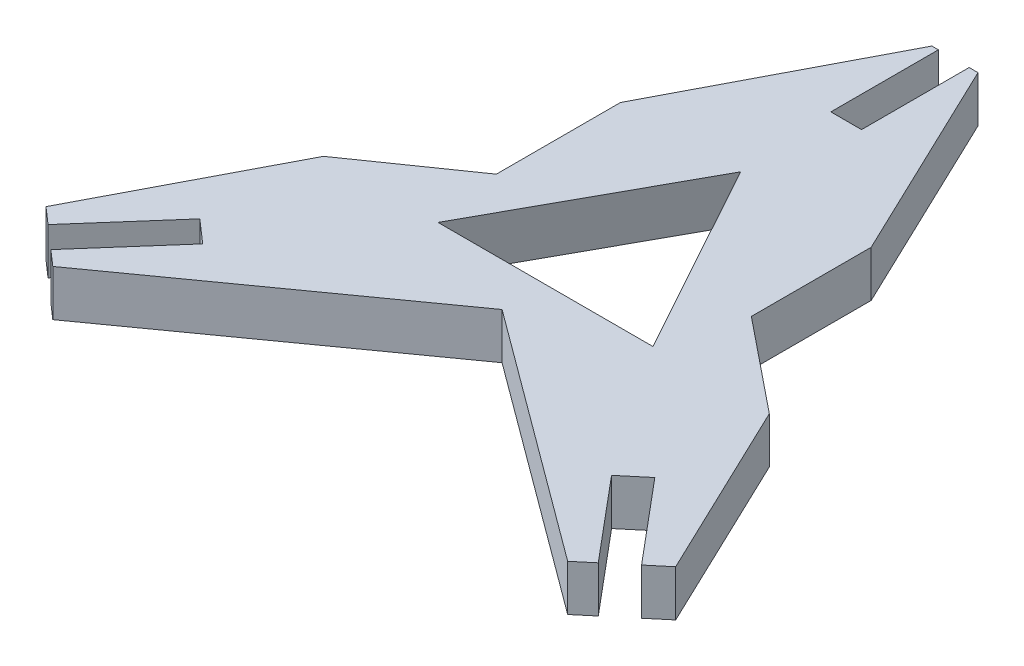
ISO-10303-21;
HEADER;
FILE_DESCRIPTION(('STEP AP214'),'2;1');
FILE_NAME('part.step','',(''),(''),'','','');
FILE_SCHEMA(('AUTOMOTIVE_DESIGN { 1 0 10303 214 1 1 1 1 }'));
ENDSEC;
DATA;
#1=APPLICATION_CONTEXT('core data for automotive mechanical design processes');
#2=APPLICATION_PROTOCOL_DEFINITION('international standard','automotive_design',2000,#1);
#3=PRODUCT_CONTEXT('',#1,'mechanical');
#4=PRODUCT('Part','Part','',(#3));
#5=PRODUCT_RELATED_PRODUCT_CATEGORY('part','',(#4));
#6=PRODUCT_DEFINITION_FORMATION('','',#4);
#7=PRODUCT_DEFINITION_CONTEXT('part definition',#1,'design');
#8=PRODUCT_DEFINITION('design','',#6,#7);
#9=PRODUCT_DEFINITION_SHAPE('','',#8);
#10=(LENGTH_UNIT() NAMED_UNIT(*) SI_UNIT(.MILLI.,.METRE.));
#11=(NAMED_UNIT(*) PLANE_ANGLE_UNIT() SI_UNIT($,.RADIAN.));
#12=(NAMED_UNIT(*) SI_UNIT($,.STERADIAN.) SOLID_ANGLE_UNIT());
#13=UNCERTAINTY_MEASURE_WITH_UNIT(LENGTH_MEASURE(1.E-05),#10,'distance_accuracy_value','');
#14=(GEOMETRIC_REPRESENTATION_CONTEXT(3) GLOBAL_UNCERTAINTY_ASSIGNED_CONTEXT((#13)) GLOBAL_UNIT_ASSIGNED_CONTEXT((#10,
#11,#12)) REPRESENTATION_CONTEXT('',''));
#15=CARTESIAN_POINT('',(0.,0.,0.));
#16=DIRECTION('',(0.,0.,1.));
#17=DIRECTION('',(1.,0.,0.));
#18=AXIS2_PLACEMENT_3D('',#15,#16,#17);
#19=CARTESIAN_POINT('',(21.2506488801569,3.,-10.1559719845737));
#20=DIRECTION('',(0.902256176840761,0.,-0.431200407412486));
#21=DIRECTION('',(-0.431200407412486,0.,-0.902256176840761));
#22=AXIS2_PLACEMENT_3D('',#19,#20,#21);
#23=PLANE('',#22);
#24=DIRECTION('',(0.,1.,0.));
#25=VECTOR('',#24,1.);
#26=CARTESIAN_POINT('',(39.969209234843,0.,29.0112839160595));
#27=LINE('',#26,#25);
#28=CARTESIAN_POINT('',(39.969209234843,0.,29.0112839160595));
#29=VERTEX_POINT('',#28);
#30=CARTESIAN_POINT('',(39.969209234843,3.,29.0112839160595));
#31=VERTEX_POINT('',#30);
#32=EDGE_CURVE('E531',#29,#31,#27,.T.);
#33=ORIENTED_EDGE('',*,*,#32,.T.);
#34=DIRECTION('',(0.431200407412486,0.,0.902256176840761));
#35=VECTOR('',#34,1.);
#36=CARTESIAN_POINT('',(21.2506488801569,3.,-10.1559719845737));
#37=LINE('',#36,#35);
#38=CARTESIAN_POINT('',(45.5472114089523,3.,40.6828566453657));
#39=VERTEX_POINT('',#38);
#40=EDGE_CURVE('E283',#31,#39,#37,.T.);
#41=ORIENTED_EDGE('',*,*,#40,.T.);
#42=DIRECTION('',(0.,1.,0.));
#43=VECTOR('',#42,1.);
#44=CARTESIAN_POINT('',(45.5472114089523,0.,40.6828566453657));
#45=LINE('',#44,#43);
#46=CARTESIAN_POINT('',(45.5472114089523,0.,40.6828566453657));
#47=VERTEX_POINT('',#46);
#48=EDGE_CURVE('E369',#47,#39,#45,.T.);
#49=ORIENTED_EDGE('',*,*,#48,.F.);
#50=DIRECTION('',(0.431200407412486,0.,0.902256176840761));
#51=VECTOR('',#50,1.);
#52=CARTESIAN_POINT('',(21.2506488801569,0.,-10.1559719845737));
#53=LINE('',#52,#51);
#54=EDGE_CURVE('E555',#29,#47,#53,.T.);
#55=ORIENTED_EDGE('',*,*,#54,.F.);
#56=EDGE_LOOP('',(#33,#41,#49,#55));
#57=FACE_BOUND('',#56,.T.);
#58=ADVANCED_FACE('F65',(#57),#23,.T.);
#59=CARTESIAN_POINT('',(20.5130063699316,3.,10.7095636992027));
#60=DIRECTION('',(-0.886458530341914,0.,-0.462808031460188));
#61=DIRECTION('',(-0.462808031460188,0.,0.886458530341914));
#62=AXIS2_PLACEMENT_3D('',#59,#60,#61);
#63=PLANE('',#62);
#64=DIRECTION('',(0.,1.,0.));
#65=VECTOR('',#64,1.);
#66=CARTESIAN_POINT('',(10.9579253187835,0.,29.0112839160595));
#67=LINE('',#66,#65);
#68=CARTESIAN_POINT('',(10.9579253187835,0.,29.0112839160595));
#69=VERTEX_POINT('',#68);
#70=CARTESIAN_POINT('',(10.9579253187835,3.,29.0112839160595));
#71=VERTEX_POINT('',#70);
#72=EDGE_CURVE('E459',#69,#71,#67,.T.);
#73=ORIENTED_EDGE('',*,*,#72,.F.);
#74=DIRECTION('',(0.462808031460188,0.,-0.886458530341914));
#75=VECTOR('',#74,1.);
#76=CARTESIAN_POINT('',(20.5130063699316,0.,10.7095636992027));
#77=LINE('',#76,#75);
#78=CARTESIAN_POINT('',(4.76326950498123,0.,40.8764744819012));
#79=VERTEX_POINT('',#78);
#80=EDGE_CURVE('E461',#79,#69,#77,.T.);
#81=ORIENTED_EDGE('',*,*,#80,.F.);
#82=DIRECTION('',(0.,1.,0.));
#83=VECTOR('',#82,1.);
#84=CARTESIAN_POINT('',(4.76326950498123,0.,40.8764744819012));
#85=LINE('',#84,#83);
#86=CARTESIAN_POINT('',(4.76326950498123,3.,40.8764744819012));
#87=VERTEX_POINT('',#86);
#88=EDGE_CURVE('E424',#79,#87,#85,.T.);
#89=ORIENTED_EDGE('',*,*,#88,.T.);
#90=DIRECTION('',(0.462808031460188,0.,-0.886458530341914));
#91=VECTOR('',#90,1.);
#92=CARTESIAN_POINT('',(20.5130063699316,3.,10.7095636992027));
#93=LINE('',#92,#91);
#94=EDGE_CURVE('E275',#87,#71,#93,.T.);
#95=ORIENTED_EDGE('',*,*,#94,.T.);
#96=EDGE_LOOP('',(#73,#81,#89,#95));
#97=FACE_BOUND('',#96,.T.);
#98=ADVANCED_FACE('F457',(#97),#63,.T.);
#99=CARTESIAN_POINT('',(0.,3.,0.));
#100=DIRECTION('',(0.,1.,0.));
#101=DIRECTION('',(0.,0.,1.));
#102=AXIS2_PLACEMENT_3D('',#99,#100,#101);
#103=PLANE('',#102);
#104=DIRECTION('',(1.,0.,0.));
#105=VECTOR('',#104,1.);
#106=CARTESIAN_POINT('',(24.96076274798,3.,3.));
#107=LINE('',#106,#105);
#108=CARTESIAN_POINT('',(24.5380654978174,3.,3.));
#109=VERTEX_POINT('',#108);
#110=CARTESIAN_POINT('',(24.96076274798,3.,3.));
#111=VERTEX_POINT('',#110);
#112=EDGE_CURVE('E252',#109,#111,#107,.T.);
#113=ORIENTED_EDGE('',*,*,#112,.F.);
#114=CARTESIAN_POINT('',(17.5866412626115,3.,16.3146983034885));
#115=VERTEX_POINT('',#114);
#116=EDGE_CURVE('E266',#115,#109,#93,.T.);
#117=ORIENTED_EDGE('',*,*,#116,.F.);
#118=DIRECTION('',(0.,0.,-1.));
#119=VECTOR('',#118,1.);
#120=CARTESIAN_POINT('',(17.5866412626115,3.,16.3146983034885));
#121=LINE('',#120,#119);
#122=CARTESIAN_POINT('',(17.5866412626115,3.,24.3933726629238));
#123=VERTEX_POINT('',#122);
#124=EDGE_CURVE('E88',#123,#115,#121,.T.);
#125=ORIENTED_EDGE('',*,*,#124,.F.);
#126=DIRECTION('',(0.820520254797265,0.,-0.571617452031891));
#127=VECTOR('',#126,1.);
#128=CARTESIAN_POINT('',(17.5866412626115,3.,24.3933726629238));
#129=LINE('',#128,#127);
#130=EDGE_CURVE('E454',#71,#123,#129,.T.);
#131=ORIENTED_EDGE('',*,*,#130,.F.);
#132=ORIENTED_EDGE('',*,*,#94,.F.);
#133=DIRECTION('',(0.751820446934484,0.,0.659367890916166));
#134=VECTOR('',#133,1.);
#135=CARTESIAN_POINT('',(4.83328330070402,3.,40.9378785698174));
#136=LINE('',#135,#134);
#137=CARTESIAN_POINT('',(5.84185846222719,3.,41.822427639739));
#138=VERTEX_POINT('',#137);
#139=EDGE_CURVE('E303',#87,#138,#136,.T.);
#140=ORIENTED_EDGE('',*,*,#139,.T.);
#141=DIRECTION('',(0.659367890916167,0.,-0.751820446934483));
#142=VECTOR('',#141,1.);
#143=CARTESIAN_POINT('',(24.0344926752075,3.,21.0789328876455));
#144=LINE('',#143,#142);
#145=CARTESIAN_POINT('',(10.4574336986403,3.,36.5596845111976));
#146=VERTEX_POINT('',#145);
#147=EDGE_CURVE('E420',#138,#146,#144,.T.);
#148=ORIENTED_EDGE('',*,*,#147,.T.);
#149=DIRECTION('',(-0.751820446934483,0.,-0.659367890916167));
#150=VECTOR('',#149,1.);
#151=CARTESIAN_POINT('',(-13.5770589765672,3.,15.4807516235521));
#152=LINE('',#151,#150);
#153=CARTESIAN_POINT('',(11.9610745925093,3.,37.87842029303));
#154=VERTEX_POINT('',#153);
#155=EDGE_CURVE('E413',#154,#146,#152,.T.);
#156=ORIENTED_EDGE('',*,*,#155,.F.);
#157=DIRECTION('',(0.659367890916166,0.,-0.751820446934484));
#158=VECTOR('',#157,1.);
#159=CARTESIAN_POINT('',(25.5381335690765,3.,22.3976686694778));
#160=LINE('',#159,#158);
#161=CARTESIAN_POINT('',(7.34549935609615,3.,43.1411634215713));
#162=VERTEX_POINT('',#161);
#163=EDGE_CURVE('E425',#162,#154,#160,.T.);
#164=ORIENTED_EDGE('',*,*,#163,.F.);
#165=CARTESIAN_POINT('',(8.35407451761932,3.,44.025712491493));
#166=VERTEX_POINT('',#165);
#167=EDGE_CURVE('E309',#162,#166,#136,.T.);
#168=ORIENTED_EDGE('',*,*,#167,.T.);
#169=DIRECTION('',(0.813406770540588,0.,-0.581695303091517));
#170=VECTOR('',#169,1.);
#171=CARTESIAN_POINT('',(23.6577448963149,3.,33.0815287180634));
#172=LINE('',#171,#170);
#173=CARTESIAN_POINT('',(25.4012074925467,3.,31.8347183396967));
#174=VERTEX_POINT('',#173);
#175=EDGE_CURVE('E73',#166,#174,#172,.T.);
#176=ORIENTED_EDGE('',*,*,#175,.T.);
#177=DIRECTION('',(0.804432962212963,0.,0.594043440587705));
#178=VECTOR('',#177,1.);
#179=CARTESIAN_POINT('',(-6.24902576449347,3.,8.46221330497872));
#180=LINE('',#179,#178);
#181=CARTESIAN_POINT('',(41.7248061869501,3.,43.8890810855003));
#182=VERTEX_POINT('',#181);
#183=EDGE_CURVE('E324',#174,#182,#180,.T.);
#184=ORIENTED_EDGE('',*,*,#183,.T.);
#185=DIRECTION('',(0.766158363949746,0.,-0.642651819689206));
#186=VECTOR('',#185,1.);
#187=CARTESIAN_POINT('',(38.8422032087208,3.,46.3070016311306));
#188=LINE('',#187,#186);
#189=CARTESIAN_POINT('',(42.8073234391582,3.,42.9810681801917));
#190=VERTEX_POINT('',#189);
#191=EDGE_CURVE('E391',#182,#190,#188,.T.);
#192=ORIENTED_EDGE('',*,*,#191,.T.);
#193=DIRECTION('',(-0.642651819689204,0.,-0.766158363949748));
#194=VECTOR('',#193,1.);
#195=CARTESIAN_POINT('',(3.96512023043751,3.,-3.32593345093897));
#196=LINE('',#195,#194);
#197=CARTESIAN_POINT('',(38.3087607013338,3.,37.6179596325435));
#198=VERTEX_POINT('',#197);
#199=EDGE_CURVE('E396',#190,#198,#196,.T.);
#200=ORIENTED_EDGE('',*,*,#199,.T.);
#201=DIRECTION('',(-0.766158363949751,0.,0.642651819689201));
#202=VECTOR('',#201,1.);
#203=CARTESIAN_POINT('',(34.3436404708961,3.,40.9438930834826));
#204=LINE('',#203,#202);
#205=CARTESIAN_POINT('',(39.8410774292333,3.,36.3326559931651));
#206=VERTEX_POINT('',#205);
#207=EDGE_CURVE('E377',#206,#198,#204,.T.);
#208=ORIENTED_EDGE('',*,*,#207,.F.);
#209=DIRECTION('',(-0.642651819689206,0.,-0.766158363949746));
#210=VECTOR('',#209,1.);
#211=CARTESIAN_POINT('',(5.49743695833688,3.,-4.6112370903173));
#212=LINE('',#211,#210);
#213=CARTESIAN_POINT('',(44.3396401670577,3.,41.6957645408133));
#214=VERTEX_POINT('',#213);
#215=EDGE_CURVE('E383',#214,#206,#212,.T.);
#216=ORIENTED_EDGE('',*,*,#215,.F.);
#217=EDGE_CURVE('E395',#214,#39,#188,.T.);
#218=ORIENTED_EDGE('',*,*,#217,.T.);
#219=ORIENTED_EDGE('',*,*,#40,.F.);
#220=DIRECTION('',(0.778106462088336,0.,0.628132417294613));
#221=VECTOR('',#220,1.);
#222=CARTESIAN_POINT('',(39.969209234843,3.,29.0112839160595));
#223=LINE('',#222,#221);
#224=CARTESIAN_POINT('',(33.9013395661,3.,24.1129495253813));
#225=VERTEX_POINT('',#224);
#226=EDGE_CURVE('E543',#225,#31,#223,.T.);
#227=ORIENTED_EDGE('',*,*,#226,.F.);
#228=DIRECTION('',(0.,0.,1.));
#229=VECTOR('',#228,1.);
#230=CARTESIAN_POINT('',(33.9013395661,3.,24.1129495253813));
#231=LINE('',#230,#229);
#232=CARTESIAN_POINT('',(33.9013395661,3.,16.3146983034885));
#233=VERTEX_POINT('',#232);
#234=EDGE_CURVE('E537',#233,#225,#231,.T.);
#235=ORIENTED_EDGE('',*,*,#234,.F.);
#236=CARTESIAN_POINT('',(27.5380654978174,3.,3.));
#237=VERTEX_POINT('',#236);
#238=EDGE_CURVE('E276',#237,#233,#37,.T.);
#239=ORIENTED_EDGE('',*,*,#238,.F.);
#240=DIRECTION('',(1.,0.,0.));
#241=VECTOR('',#240,1.);
#242=CARTESIAN_POINT('',(0.,3.,3.));
#243=LINE('',#242,#241);
#244=CARTESIAN_POINT('',(26.96076274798,3.,3.));
#245=VERTEX_POINT('',#244);
#246=EDGE_CURVE('E490',#245,#237,#243,.T.);
#247=ORIENTED_EDGE('',*,*,#246,.F.);
#248=DIRECTION('',(0.,0.,1.));
#249=VECTOR('',#248,1.);
#250=CARTESIAN_POINT('',(26.96076274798,3.,0.));
#251=LINE('',#250,#249);
#252=CARTESIAN_POINT('',(26.96076274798,3.,10.));
#253=VERTEX_POINT('',#252);
#254=EDGE_CURVE('E485',#245,#253,#251,.T.);
#255=ORIENTED_EDGE('',*,*,#254,.T.);
#256=DIRECTION('',(1.,0.,0.));
#257=VECTOR('',#256,1.);
#258=CARTESIAN_POINT('',(0.,3.,10.));
#259=LINE('',#258,#257);
#260=CARTESIAN_POINT('',(24.96076274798,3.,10.));
#261=VERTEX_POINT('',#260);
#262=EDGE_CURVE('E474',#261,#253,#259,.T.);
#263=ORIENTED_EDGE('',*,*,#262,.F.);
#264=DIRECTION('',(0.,0.,1.));
#265=VECTOR('',#264,1.);
#266=CARTESIAN_POINT('',(24.96076274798,3.,0.));
#267=LINE('',#266,#265);
#268=EDGE_CURVE('E269',#111,#261,#267,.T.);
#269=ORIENTED_EDGE('',*,*,#268,.F.);
#270=EDGE_LOOP('',(#113,#117,#125,#131,#132,#140,#148,#156,#164,#168,#176,#184,#192,#200,#208,
#216,#218,#219,#227,#235,#239,#247,#255,#263,#269));
#271=FACE_BOUND('',#270,.T.);
#272=DIRECTION('',(-0.482468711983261,0.,-0.875913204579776));
#273=VECTOR('',#272,1.);
#274=CARTESIAN_POINT('',(32.3947146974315,3.,29.0112839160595));
#275=LINE('',#274,#273);
#276=CARTESIAN_POINT('',(32.3947146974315,3.,29.0112839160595));
#277=VERTEX_POINT('',#276);
#278=CARTESIAN_POINT('',(25.4012074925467,3.,16.3146983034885));
#279=VERTEX_POINT('',#278);
#280=EDGE_CURVE('E351',#277,#279,#275,.T.);
#281=ORIENTED_EDGE('',*,*,#280,.F.);
#282=DIRECTION('',(1.,0.,0.));
#283=VECTOR('',#282,1.);
#284=CARTESIAN_POINT('',(18.407700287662,3.,29.0112839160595));
#285=LINE('',#284,#283);
#286=CARTESIAN_POINT('',(18.407700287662,3.,29.0112839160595));
#287=VERTEX_POINT('',#286);
#288=EDGE_CURVE('E339',#287,#277,#285,.T.);
#289=ORIENTED_EDGE('',*,*,#288,.F.);
#290=DIRECTION('',(-0.482468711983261,0.,0.875913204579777));
#291=VECTOR('',#290,1.);
#292=CARTESIAN_POINT('',(25.4012074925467,3.,16.3146983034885));
#293=LINE('',#292,#291);
#294=EDGE_CURVE('E344',#279,#287,#293,.T.);
#295=ORIENTED_EDGE('',*,*,#294,.F.);
#296=EDGE_LOOP('',(#281,#289,#295));
#297=FACE_BOUND('',#296,.T.);
#298=ADVANCED_FACE('F264',(#271,#297),#103,.T.);
#299=CARTESIAN_POINT('',(0.,0.,0.));
#300=DIRECTION('',(0.,1.,0.));
#301=DIRECTION('',(0.,0.,1.));
#302=AXIS2_PLACEMENT_3D('',#299,#300,#301);
#303=PLANE('',#302);
#304=DIRECTION('',(1.,0.,0.));
#305=VECTOR('',#304,1.);
#306=CARTESIAN_POINT('',(18.407700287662,0.,29.0112839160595));
#307=LINE('',#306,#305);
#308=CARTESIAN_POINT('',(18.407700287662,0.,29.0112839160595));
#309=VERTEX_POINT('',#308);
#310=CARTESIAN_POINT('',(32.3947146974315,0.,29.0112839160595));
#311=VERTEX_POINT('',#310);
#312=EDGE_CURVE('E334',#309,#311,#307,.T.);
#313=ORIENTED_EDGE('',*,*,#312,.T.);
#314=DIRECTION('',(-0.482468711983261,0.,-0.875913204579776));
#315=VECTOR('',#314,1.);
#316=CARTESIAN_POINT('',(32.3947146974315,0.,29.0112839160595));
#317=LINE('',#316,#315);
#318=CARTESIAN_POINT('',(25.4012074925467,0.,16.3146983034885));
#319=VERTEX_POINT('',#318);
#320=EDGE_CURVE('E343',#311,#319,#317,.T.);
#321=ORIENTED_EDGE('',*,*,#320,.T.);
#322=DIRECTION('',(-0.482468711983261,0.,0.875913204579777));
#323=VECTOR('',#322,1.);
#324=CARTESIAN_POINT('',(25.4012074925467,0.,16.3146983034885));
#325=LINE('',#324,#323);
#326=EDGE_CURVE('E358',#319,#309,#325,.T.);
#327=ORIENTED_EDGE('',*,*,#326,.T.);
#328=EDGE_LOOP('',(#313,#321,#327));
#329=FACE_BOUND('',#328,.T.);
#330=CARTESIAN_POINT('',(17.5866412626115,0.,16.3146983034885));
#331=VERTEX_POINT('',#330);
#332=CARTESIAN_POINT('',(24.5380654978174,0.,3.));
#333=VERTEX_POINT('',#332);
#334=EDGE_CURVE('E564',#331,#333,#77,.T.);
#335=ORIENTED_EDGE('',*,*,#334,.T.);
#336=DIRECTION('',(1.,0.,0.));
#337=VECTOR('',#336,1.);
#338=CARTESIAN_POINT('',(0.,0.,2.9999999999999));
#339=LINE('',#338,#337);
#340=CARTESIAN_POINT('',(24.96076274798,0.,3.));
#341=VERTEX_POINT('',#340);
#342=EDGE_CURVE('E255',#333,#341,#339,.T.);
#343=ORIENTED_EDGE('',*,*,#342,.T.);
#344=DIRECTION('',(0.,0.,1.));
#345=VECTOR('',#344,1.);
#346=CARTESIAN_POINT('',(24.96076274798,0.,0.));
#347=LINE('',#346,#345);
#348=CARTESIAN_POINT('',(24.96076274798,0.,10.));
#349=VERTEX_POINT('',#348);
#350=EDGE_CURVE('E509',#341,#349,#347,.T.);
#351=ORIENTED_EDGE('',*,*,#350,.T.);
#352=DIRECTION('',(1.,0.,0.));
#353=VECTOR('',#352,1.);
#354=CARTESIAN_POINT('',(0.,0.,10.));
#355=LINE('',#354,#353);
#356=CARTESIAN_POINT('',(26.96076274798,0.,10.));
#357=VERTEX_POINT('',#356);
#358=EDGE_CURVE('E466',#349,#357,#355,.T.);
#359=ORIENTED_EDGE('',*,*,#358,.T.);
#360=DIRECTION('',(0.,0.,1.));
#361=VECTOR('',#360,1.);
#362=CARTESIAN_POINT('',(26.96076274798,0.,0.));
#363=LINE('',#362,#361);
#364=CARTESIAN_POINT('',(26.96076274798,0.,3.));
#365=VERTEX_POINT('',#364);
#366=EDGE_CURVE('E478',#365,#357,#363,.T.);
#367=ORIENTED_EDGE('',*,*,#366,.F.);
#368=DIRECTION('',(1.,0.,0.));
#369=VECTOR('',#368,1.);
#370=CARTESIAN_POINT('',(0.,0.,3.));
#371=LINE('',#370,#369);
#372=CARTESIAN_POINT('',(27.5380654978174,0.,3.));
#373=VERTEX_POINT('',#372);
#374=EDGE_CURVE('E511',#365,#373,#371,.T.);
#375=ORIENTED_EDGE('',*,*,#374,.T.);
#376=CARTESIAN_POINT('',(33.9013395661,0.,16.3146983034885));
#377=VERTEX_POINT('',#376);
#378=EDGE_CURVE('E562',#373,#377,#53,.T.);
#379=ORIENTED_EDGE('',*,*,#378,.T.);
#380=DIRECTION('',(0.,0.,1.));
#381=VECTOR('',#380,1.);
#382=CARTESIAN_POINT('',(33.9013395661,0.,24.1129495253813));
#383=LINE('',#382,#381);
#384=CARTESIAN_POINT('',(33.9013395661,0.,24.1129495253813));
#385=VERTEX_POINT('',#384);
#386=EDGE_CURVE('E80',#377,#385,#383,.T.);
#387=ORIENTED_EDGE('',*,*,#386,.T.);
#388=DIRECTION('',(0.778106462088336,0.,0.628132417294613));
#389=VECTOR('',#388,1.);
#390=CARTESIAN_POINT('',(39.969209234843,0.,29.0112839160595));
#391=LINE('',#390,#389);
#392=EDGE_CURVE('E542',#385,#29,#391,.T.);
#393=ORIENTED_EDGE('',*,*,#392,.T.);
#394=ORIENTED_EDGE('',*,*,#54,.T.);
#395=DIRECTION('',(0.766158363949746,0.,-0.642651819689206));
#396=VECTOR('',#395,1.);
#397=CARTESIAN_POINT('',(38.8422032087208,0.,46.3070016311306));
#398=LINE('',#397,#396);
#399=CARTESIAN_POINT('',(44.3396401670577,0.,41.6957645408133));
#400=VERTEX_POINT('',#399);
#401=EDGE_CURVE('E407',#400,#47,#398,.T.);
#402=ORIENTED_EDGE('',*,*,#401,.F.);
#403=DIRECTION('',(-0.642651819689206,0.,-0.766158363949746));
#404=VECTOR('',#403,1.);
#405=CARTESIAN_POINT('',(5.49743695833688,0.,-4.6112370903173));
#406=LINE('',#405,#404);
#407=CARTESIAN_POINT('',(39.8410774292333,0.,36.3326559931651));
#408=VERTEX_POINT('',#407);
#409=EDGE_CURVE('E404',#400,#408,#406,.T.);
#410=ORIENTED_EDGE('',*,*,#409,.T.);
#411=DIRECTION('',(-0.766158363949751,0.,0.642651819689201));
#412=VECTOR('',#411,1.);
#413=CARTESIAN_POINT('',(34.3436404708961,0.,40.9438930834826));
#414=LINE('',#413,#412);
#415=CARTESIAN_POINT('',(38.3087607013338,0.,37.6179596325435));
#416=VERTEX_POINT('',#415);
#417=EDGE_CURVE('E366',#408,#416,#414,.T.);
#418=ORIENTED_EDGE('',*,*,#417,.T.);
#419=DIRECTION('',(-0.642651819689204,0.,-0.766158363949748));
#420=VECTOR('',#419,1.);
#421=CARTESIAN_POINT('',(3.96512023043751,0.,-3.32593345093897));
#422=LINE('',#421,#420);
#423=CARTESIAN_POINT('',(42.8073234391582,0.,42.9810681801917));
#424=VERTEX_POINT('',#423);
#425=EDGE_CURVE('E382',#424,#416,#422,.T.);
#426=ORIENTED_EDGE('',*,*,#425,.F.);
#427=CARTESIAN_POINT('',(41.7248061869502,0.,43.8890810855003));
#428=VERTEX_POINT('',#427);
#429=EDGE_CURVE('E408',#428,#424,#398,.T.);
#430=ORIENTED_EDGE('',*,*,#429,.F.);
#431=DIRECTION('',(0.804432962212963,0.,0.594043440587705));
#432=VECTOR('',#431,1.);
#433=CARTESIAN_POINT('',(-6.24902576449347,0.,8.46221330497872));
#434=LINE('',#433,#432);
#435=CARTESIAN_POINT('',(25.4012074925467,0.,31.8347183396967));
#436=VERTEX_POINT('',#435);
#437=EDGE_CURVE('E338',#436,#428,#434,.T.);
#438=ORIENTED_EDGE('',*,*,#437,.F.);
#439=DIRECTION('',(0.813406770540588,0.,-0.581695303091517));
#440=VECTOR('',#439,1.);
#441=CARTESIAN_POINT('',(23.6577448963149,0.,33.0815287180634));
#442=LINE('',#441,#440);
#443=CARTESIAN_POINT('',(8.35407451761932,0.,44.025712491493));
#444=VERTEX_POINT('',#443);
#445=EDGE_CURVE('E329',#444,#436,#442,.T.);
#446=ORIENTED_EDGE('',*,*,#445,.F.);
#447=DIRECTION('',(-0.751820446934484,0.,-0.659367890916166));
#448=VECTOR('',#447,1.);
#449=CARTESIAN_POINT('',(4.83328330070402,0.,40.9378785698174));
#450=LINE('',#449,#448);
#451=CARTESIAN_POINT('',(7.34549935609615,0.,43.1411634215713));
#452=VERTEX_POINT('',#451);
#453=EDGE_CURVE('E313',#444,#452,#450,.T.);
#454=ORIENTED_EDGE('',*,*,#453,.T.);
#455=DIRECTION('',(0.659367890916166,0.,-0.751820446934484));
#456=VECTOR('',#455,1.);
#457=CARTESIAN_POINT('',(25.5381335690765,0.,22.3976686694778));
#458=LINE('',#457,#456);
#459=CARTESIAN_POINT('',(11.9610745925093,0.,37.87842029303));
#460=VERTEX_POINT('',#459);
#461=EDGE_CURVE('E414',#452,#460,#458,.T.);
#462=ORIENTED_EDGE('',*,*,#461,.T.);
#463=DIRECTION('',(-0.751820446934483,0.,-0.659367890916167));
#464=VECTOR('',#463,1.);
#465=CARTESIAN_POINT('',(-13.5770589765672,0.,15.4807516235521));
#466=LINE('',#465,#464);
#467=CARTESIAN_POINT('',(10.4574336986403,0.,36.5596845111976));
#468=VERTEX_POINT('',#467);
#469=EDGE_CURVE('E417',#460,#468,#466,.T.);
#470=ORIENTED_EDGE('',*,*,#469,.T.);
#471=DIRECTION('',(0.659367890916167,0.,-0.751820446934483));
#472=VECTOR('',#471,1.);
#473=CARTESIAN_POINT('',(24.0344926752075,0.,21.0789328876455));
#474=LINE('',#473,#472);
#475=CARTESIAN_POINT('',(5.84185846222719,0.,41.822427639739));
#476=VERTEX_POINT('',#475);
#477=EDGE_CURVE('E411',#476,#468,#474,.T.);
#478=ORIENTED_EDGE('',*,*,#477,.F.);
#479=EDGE_CURVE('E310',#476,#79,#450,.T.);
#480=ORIENTED_EDGE('',*,*,#479,.T.);
#481=ORIENTED_EDGE('',*,*,#80,.T.);
#482=DIRECTION('',(0.820520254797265,0.,-0.571617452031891));
#483=VECTOR('',#482,1.);
#484=CARTESIAN_POINT('',(17.5866412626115,0.,24.3933726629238));
#485=LINE('',#484,#483);
#486=CARTESIAN_POINT('',(17.5866412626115,0.,24.3933726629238));
#487=VERTEX_POINT('',#486);
#488=EDGE_CURVE('E522',#69,#487,#485,.T.);
#489=ORIENTED_EDGE('',*,*,#488,.T.);
#490=DIRECTION('',(0.,0.,-1.));
#491=VECTOR('',#490,1.);
#492=CARTESIAN_POINT('',(17.5866412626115,0.,16.3146983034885));
#493=LINE('',#492,#491);
#494=EDGE_CURVE('E518',#487,#331,#493,.T.);
#495=ORIENTED_EDGE('',*,*,#494,.T.);
#496=EDGE_LOOP('',(#335,#343,#351,#359,#367,#375,#379,#387,#393,#394,#402,#410,#418,#426,#430,
#438,#446,#454,#462,#470,#478,#480,#481,#489,#495));
#497=FACE_BOUND('',#496,.T.);
#498=ADVANCED_FACE('F510',(#329,#497),#303,.F.);
#499=DIRECTION('',(0.,1.,0.));
#500=VECTOR('',#499,1.);
#501=CARTESIAN_POINT('',(24.5380654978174,-1.25,3.));
#502=LINE('',#501,#500);
#503=EDGE_CURVE('E249',#333,#109,#502,.T.);
#504=ORIENTED_EDGE('',*,*,#503,.F.);
#505=ORIENTED_EDGE('',*,*,#334,.F.);
#506=DIRECTION('',(0.,1.,0.));
#507=VECTOR('',#506,1.);
#508=CARTESIAN_POINT('',(17.5866412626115,0.,16.3146983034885));
#509=LINE('',#508,#507);
#510=EDGE_CURVE('E273',#331,#115,#509,.T.);
#511=ORIENTED_EDGE('',*,*,#510,.T.);
#512=ORIENTED_EDGE('',*,*,#116,.T.);
#513=EDGE_LOOP('',(#504,#505,#511,#512));
#514=FACE_BOUND('',#513,.T.);
#515=ADVANCED_FACE('F272',(#514),#63,.T.);
#516=CARTESIAN_POINT('',(23.6577448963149,3.,33.0815287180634));
#517=DIRECTION('',(-0.581695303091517,0.,-0.813406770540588));
#518=DIRECTION('',(-0.813406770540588,0.,0.581695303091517));
#519=AXIS2_PLACEMENT_3D('',#516,#517,#518);
#520=PLANE('',#519);
#521=DIRECTION('',(0.,1.,0.));
#522=VECTOR('',#521,1.);
#523=CARTESIAN_POINT('',(8.35407451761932,0.,44.025712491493));
#524=LINE('',#523,#522);
#525=EDGE_CURVE('E311',#444,#166,#524,.T.);
#526=ORIENTED_EDGE('',*,*,#525,.F.);
#527=ORIENTED_EDGE('',*,*,#445,.T.);
#528=DIRECTION('',(0.,-1.,0.));
#529=VECTOR('',#528,1.);
#530=CARTESIAN_POINT('',(25.4012074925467,3.,31.8347183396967));
#531=LINE('',#530,#529);
#532=EDGE_CURVE('E13',#174,#436,#531,.T.);
#533=ORIENTED_EDGE('',*,*,#532,.F.);
#534=ORIENTED_EDGE('',*,*,#175,.F.);
#535=EDGE_LOOP('',(#526,#527,#533,#534));
#536=FACE_BOUND('',#535,.T.);
#537=ADVANCED_FACE('F571',(#536),#520,.F.);
#538=CARTESIAN_POINT('',(-6.24902576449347,3.,8.46221330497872));
#539=DIRECTION('',(0.594043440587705,0.,-0.804432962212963));
#540=DIRECTION('',(-0.804432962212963,0.,-0.594043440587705));
#541=AXIS2_PLACEMENT_3D('',#538,#539,#540);
#542=PLANE('',#541);
#543=DIRECTION('',(0.,1.,0.));
#544=VECTOR('',#543,1.);
#545=CARTESIAN_POINT('',(41.7248061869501,0.,43.8890810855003));
#546=LINE('',#545,#544);
#547=EDGE_CURVE('E365',#428,#182,#546,.T.);
#548=ORIENTED_EDGE('',*,*,#547,.T.);
#549=ORIENTED_EDGE('',*,*,#183,.F.);
#550=ORIENTED_EDGE('',*,*,#532,.T.);
#551=ORIENTED_EDGE('',*,*,#437,.T.);
#552=EDGE_LOOP('',(#548,#549,#550,#551));
#553=FACE_BOUND('',#552,.T.);
#554=ADVANCED_FACE('F67',(#553),#542,.F.);
#555=DIRECTION('',(0.,1.,0.));
#556=VECTOR('',#555,1.);
#557=CARTESIAN_POINT('',(33.9013395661,0.,16.3146983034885));
#558=LINE('',#557,#556);
#559=EDGE_CURVE('E534',#377,#233,#558,.T.);
#560=ORIENTED_EDGE('',*,*,#559,.F.);
#561=ORIENTED_EDGE('',*,*,#378,.F.);
#562=DIRECTION('',(0.,1.,0.));
#563=VECTOR('',#562,1.);
#564=CARTESIAN_POINT('',(27.5380654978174,0.,3.));
#565=LINE('',#564,#563);
#566=EDGE_CURVE('E465',#373,#237,#565,.T.);
#567=ORIENTED_EDGE('',*,*,#566,.T.);
#568=ORIENTED_EDGE('',*,*,#238,.T.);
#569=EDGE_LOOP('',(#560,#561,#567,#568));
#570=FACE_BOUND('',#569,.T.);
#571=ADVANCED_FACE('F619',(#570),#23,.T.);
#572=CARTESIAN_POINT('',(32.3947146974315,0.,29.0112839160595));
#573=DIRECTION('',(0.875913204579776,0.,-0.482468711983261));
#574=DIRECTION('',(-0.482468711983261,0.,-0.875913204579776));
#575=AXIS2_PLACEMENT_3D('',#572,#573,#574);
#576=PLANE('',#575);
#577=ORIENTED_EDGE('',*,*,#280,.T.);
#578=DIRECTION('',(0.,1.,0.));
#579=VECTOR('',#578,1.);
#580=CARTESIAN_POINT('',(25.4012074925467,0.,16.3146983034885));
#581=LINE('',#580,#579);
#582=EDGE_CURVE('E330',#319,#279,#581,.T.);
#583=ORIENTED_EDGE('',*,*,#582,.F.);
#584=ORIENTED_EDGE('',*,*,#320,.F.);
#585=DIRECTION('',(0.,1.,0.));
#586=VECTOR('',#585,1.);
#587=CARTESIAN_POINT('',(32.3947146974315,0.,29.0112839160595));
#588=LINE('',#587,#586);
#589=EDGE_CURVE('E336',#311,#277,#588,.T.);
#590=ORIENTED_EDGE('',*,*,#589,.T.);
#591=EDGE_LOOP('',(#577,#583,#584,#590));
#592=FACE_BOUND('',#591,.T.);
#593=ADVANCED_FACE('F625',(#592),#576,.F.);
#594=CARTESIAN_POINT('',(18.407700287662,0.,29.0112839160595));
#595=DIRECTION('',(0.,0.,1.));
#596=DIRECTION('',(1.,0.,0.));
#597=AXIS2_PLACEMENT_3D('',#594,#595,#596);
#598=PLANE('',#597);
#599=ORIENTED_EDGE('',*,*,#288,.T.);
#600=ORIENTED_EDGE('',*,*,#589,.F.);
#601=ORIENTED_EDGE('',*,*,#312,.F.);
#602=DIRECTION('',(0.,1.,0.));
#603=VECTOR('',#602,1.);
#604=CARTESIAN_POINT('',(18.407700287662,0.,29.0112839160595));
#605=LINE('',#604,#603);
#606=EDGE_CURVE('E333',#309,#287,#605,.T.);
#607=ORIENTED_EDGE('',*,*,#606,.T.);
#608=EDGE_LOOP('',(#599,#600,#601,#607));
#609=FACE_BOUND('',#608,.T.);
#610=ADVANCED_FACE('F631',(#609),#598,.F.);
#611=CARTESIAN_POINT('',(25.4012074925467,0.,16.3146983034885));
#612=DIRECTION('',(-0.875913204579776,0.,-0.482468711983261));
#613=DIRECTION('',(-0.482468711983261,0.,0.875913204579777));
#614=AXIS2_PLACEMENT_3D('',#611,#612,#613);
#615=PLANE('',#614);
#616=ORIENTED_EDGE('',*,*,#294,.T.);
#617=ORIENTED_EDGE('',*,*,#606,.F.);
#618=ORIENTED_EDGE('',*,*,#326,.F.);
#619=ORIENTED_EDGE('',*,*,#582,.T.);
#620=EDGE_LOOP('',(#616,#617,#618,#619));
#621=FACE_BOUND('',#620,.T.);
#622=ADVANCED_FACE('F615',(#621),#615,.F.);
#623=CARTESIAN_POINT('',(3.96512023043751,0.,-3.32593345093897));
#624=DIRECTION('',(0.766158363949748,0.,-0.642651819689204));
#625=DIRECTION('',(-0.642651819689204,0.,-0.766158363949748));
#626=AXIS2_PLACEMENT_3D('',#623,#624,#625);
#627=PLANE('',#626);
#628=ORIENTED_EDGE('',*,*,#199,.F.);
#629=DIRECTION('',(0.,1.,0.));
#630=VECTOR('',#629,1.);
#631=CARTESIAN_POINT('',(42.8073234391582,0.,42.9810681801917));
#632=LINE('',#631,#630);
#633=EDGE_CURVE('E363',#424,#190,#632,.T.);
#634=ORIENTED_EDGE('',*,*,#633,.F.);
#635=ORIENTED_EDGE('',*,*,#425,.T.);
#636=DIRECTION('',(0.,1.,0.));
#637=VECTOR('',#636,1.);
#638=CARTESIAN_POINT('',(38.3087607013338,0.,37.6179596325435));
#639=LINE('',#638,#637);
#640=EDGE_CURVE('E355',#416,#198,#639,.T.);
#641=ORIENTED_EDGE('',*,*,#640,.T.);
#642=EDGE_LOOP('',(#628,#634,#635,#641));
#643=FACE_BOUND('',#642,.T.);
#644=ADVANCED_FACE('F584',(#643),#627,.T.);
#645=CARTESIAN_POINT('',(34.3436404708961,0.,40.9438930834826));
#646=DIRECTION('',(-0.642651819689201,0.,-0.766158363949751));
#647=DIRECTION('',(-0.766158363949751,0.,0.642651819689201));
#648=AXIS2_PLACEMENT_3D('',#645,#646,#647);
#649=PLANE('',#648);
#650=ORIENTED_EDGE('',*,*,#207,.T.);
#651=ORIENTED_EDGE('',*,*,#640,.F.);
#652=ORIENTED_EDGE('',*,*,#417,.F.);
#653=DIRECTION('',(0.,1.,0.));
#654=VECTOR('',#653,1.);
#655=CARTESIAN_POINT('',(39.8410774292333,0.,36.3326559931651));
#656=LINE('',#655,#654);
#657=EDGE_CURVE('E374',#408,#206,#656,.T.);
#658=ORIENTED_EDGE('',*,*,#657,.T.);
#659=EDGE_LOOP('',(#650,#651,#652,#658));
#660=FACE_BOUND('',#659,.T.);
#661=ADVANCED_FACE('F607',(#660),#649,.F.);
#662=CARTESIAN_POINT('',(5.49743695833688,0.,-4.6112370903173));
#663=DIRECTION('',(0.766158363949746,0.,-0.642651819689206));
#664=DIRECTION('',(-0.642651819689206,0.,-0.766158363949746));
#665=AXIS2_PLACEMENT_3D('',#662,#663,#664);
#666=PLANE('',#665);
#667=ORIENTED_EDGE('',*,*,#215,.T.);
#668=ORIENTED_EDGE('',*,*,#657,.F.);
#669=ORIENTED_EDGE('',*,*,#409,.F.);
#670=DIRECTION('',(0.,1.,0.));
#671=VECTOR('',#670,1.);
#672=CARTESIAN_POINT('',(44.3396401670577,0.,41.6957645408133));
#673=LINE('',#672,#671);
#674=EDGE_CURVE('E372',#400,#214,#673,.T.);
#675=ORIENTED_EDGE('',*,*,#674,.T.);
#676=EDGE_LOOP('',(#667,#668,#669,#675));
#677=FACE_BOUND('',#676,.T.);
#678=ADVANCED_FACE('F603',(#677),#666,.F.);
#679=CARTESIAN_POINT('',(38.8422032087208,0.,46.3070016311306));
#680=DIRECTION('',(0.642651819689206,0.,0.766158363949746));
#681=DIRECTION('',(0.766158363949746,0.,-0.642651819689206));
#682=AXIS2_PLACEMENT_3D('',#679,#680,#681);
#683=PLANE('',#682);
#684=ORIENTED_EDGE('',*,*,#217,.F.);
#685=ORIENTED_EDGE('',*,*,#674,.F.);
#686=ORIENTED_EDGE('',*,*,#401,.T.);
#687=ORIENTED_EDGE('',*,*,#48,.T.);
#688=EDGE_LOOP('',(#684,#685,#686,#687));
#689=FACE_BOUND('',#688,.T.);
#690=ADVANCED_FACE('F600',(#689),#683,.T.);
#691=ORIENTED_EDGE('',*,*,#191,.F.);
#692=ORIENTED_EDGE('',*,*,#547,.F.);
#693=ORIENTED_EDGE('',*,*,#429,.T.);
#694=ORIENTED_EDGE('',*,*,#633,.T.);
#695=EDGE_LOOP('',(#691,#692,#693,#694));
#696=FACE_BOUND('',#695,.T.);
#697=ADVANCED_FACE('F581',(#696),#683,.T.);
#698=CARTESIAN_POINT('',(24.0344926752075,0.,21.0789328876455));
#699=DIRECTION('',(0.751820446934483,0.,0.659367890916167));
#700=DIRECTION('',(0.659367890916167,0.,-0.751820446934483));
#701=AXIS2_PLACEMENT_3D('',#698,#699,#700);
#702=PLANE('',#701);
#703=ORIENTED_EDGE('',*,*,#147,.F.);
#704=DIRECTION('',(0.,1.,0.));
#705=VECTOR('',#704,1.);
#706=CARTESIAN_POINT('',(5.84185846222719,0.,41.822427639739));
#707=LINE('',#706,#705);
#708=EDGE_CURVE('E419',#476,#138,#707,.T.);
#709=ORIENTED_EDGE('',*,*,#708,.F.);
#710=ORIENTED_EDGE('',*,*,#477,.T.);
#711=DIRECTION('',(0.,1.,0.));
#712=VECTOR('',#711,1.);
#713=CARTESIAN_POINT('',(10.4574336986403,0.,36.5596845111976));
#714=LINE('',#713,#712);
#715=EDGE_CURVE('E434',#468,#146,#714,.T.);
#716=ORIENTED_EDGE('',*,*,#715,.T.);
#717=EDGE_LOOP('',(#703,#709,#710,#716));
#718=FACE_BOUND('',#717,.T.);
#719=ADVANCED_FACE('F448',(#718),#702,.T.);
#720=CARTESIAN_POINT('',(-13.5770589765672,0.,15.4807516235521));
#721=DIRECTION('',(0.659367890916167,0.,-0.751820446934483));
#722=DIRECTION('',(-0.751820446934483,0.,-0.659367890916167));
#723=AXIS2_PLACEMENT_3D('',#720,#721,#722);
#724=PLANE('',#723);
#725=ORIENTED_EDGE('',*,*,#155,.T.);
#726=ORIENTED_EDGE('',*,*,#715,.F.);
#727=ORIENTED_EDGE('',*,*,#469,.F.);
#728=DIRECTION('',(0.,1.,0.));
#729=VECTOR('',#728,1.);
#730=CARTESIAN_POINT('',(11.9610745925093,0.,37.87842029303));
#731=LINE('',#730,#729);
#732=EDGE_CURVE('E436',#460,#154,#731,.T.);
#733=ORIENTED_EDGE('',*,*,#732,.T.);
#734=EDGE_LOOP('',(#725,#726,#727,#733));
#735=FACE_BOUND('',#734,.T.);
#736=ADVANCED_FACE('F672',(#735),#724,.F.);
#737=CARTESIAN_POINT('',(25.5381335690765,0.,22.3976686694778));
#738=DIRECTION('',(0.751820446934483,0.,0.659367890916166));
#739=DIRECTION('',(0.659367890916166,0.,-0.751820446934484));
#740=AXIS2_PLACEMENT_3D('',#737,#738,#739);
#741=PLANE('',#740);
#742=ORIENTED_EDGE('',*,*,#163,.T.);
#743=ORIENTED_EDGE('',*,*,#732,.F.);
#744=ORIENTED_EDGE('',*,*,#461,.F.);
#745=DIRECTION('',(0.,1.,0.));
#746=VECTOR('',#745,1.);
#747=CARTESIAN_POINT('',(7.34549935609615,0.,43.1411634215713));
#748=LINE('',#747,#746);
#749=EDGE_CURVE('E439',#452,#162,#748,.T.);
#750=ORIENTED_EDGE('',*,*,#749,.T.);
#751=EDGE_LOOP('',(#742,#743,#744,#750));
#752=FACE_BOUND('',#751,.T.);
#753=ADVANCED_FACE('F666',(#752),#741,.F.);
#754=CARTESIAN_POINT('',(4.83328330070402,0.,40.9378785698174));
#755=DIRECTION('',(-0.659367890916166,0.,0.751820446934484));
#756=DIRECTION('',(0.751820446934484,0.,0.659367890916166));
#757=AXIS2_PLACEMENT_3D('',#754,#755,#756);
#758=PLANE('',#757);
#759=ORIENTED_EDGE('',*,*,#453,.F.);
#760=ORIENTED_EDGE('',*,*,#525,.T.);
#761=ORIENTED_EDGE('',*,*,#167,.F.);
#762=ORIENTED_EDGE('',*,*,#749,.F.);
#763=EDGE_LOOP('',(#759,#760,#761,#762));
#764=FACE_BOUND('',#763,.T.);
#765=ADVANCED_FACE('F669',(#764),#758,.T.);
#766=ORIENTED_EDGE('',*,*,#708,.T.);
#767=ORIENTED_EDGE('',*,*,#139,.F.);
#768=ORIENTED_EDGE('',*,*,#88,.F.);
#769=ORIENTED_EDGE('',*,*,#479,.F.);
#770=EDGE_LOOP('',(#766,#767,#768,#769));
#771=FACE_BOUND('',#770,.T.);
#772=ADVANCED_FACE('F443',(#771),#758,.T.);
#773=CARTESIAN_POINT('',(26.96076274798,0.,0.));
#774=DIRECTION('',(-1.,0.,0.));
#775=DIRECTION('',(0.,0.,1.));
#776=AXIS2_PLACEMENT_3D('',#773,#774,#775);
#777=PLANE('',#776);
#778=ORIENTED_EDGE('',*,*,#254,.F.);
#779=DIRECTION('',(0.,1.,0.));
#780=VECTOR('',#779,1.);
#781=CARTESIAN_POINT('',(26.96076274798,0.,3.));
#782=LINE('',#781,#780);
#783=EDGE_CURVE('E463',#365,#245,#782,.T.);
#784=ORIENTED_EDGE('',*,*,#783,.F.);
#785=ORIENTED_EDGE('',*,*,#366,.T.);
#786=DIRECTION('',(0.,1.,0.));
#787=VECTOR('',#786,1.);
#788=CARTESIAN_POINT('',(26.96076274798,0.,10.));
#789=LINE('',#788,#787);
#790=EDGE_CURVE('E437',#357,#253,#789,.T.);
#791=ORIENTED_EDGE('',*,*,#790,.T.);
#792=EDGE_LOOP('',(#778,#784,#785,#791));
#793=FACE_BOUND('',#792,.T.);
#794=ADVANCED_FACE('F658',(#793),#777,.T.);
#795=CARTESIAN_POINT('',(0.,0.,10.));
#796=DIRECTION('',(0.,0.,1.));
#797=DIRECTION('',(1.,0.,0.));
#798=AXIS2_PLACEMENT_3D('',#795,#796,#797);
#799=PLANE('',#798);
#800=ORIENTED_EDGE('',*,*,#262,.T.);
#801=ORIENTED_EDGE('',*,*,#790,.F.);
#802=ORIENTED_EDGE('',*,*,#358,.F.);
#803=DIRECTION('',(0.,1.,0.));
#804=VECTOR('',#803,1.);
#805=CARTESIAN_POINT('',(24.96076274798,0.,10.));
#806=LINE('',#805,#804);
#807=EDGE_CURVE('E471',#349,#261,#806,.T.);
#808=ORIENTED_EDGE('',*,*,#807,.T.);
#809=EDGE_LOOP('',(#800,#801,#802,#808));
#810=FACE_BOUND('',#809,.T.);
#811=ADVANCED_FACE('F504',(#810),#799,.F.);
#812=CARTESIAN_POINT('',(24.96076274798,0.,0.));
#813=DIRECTION('',(-1.,0.,0.));
#814=DIRECTION('',(0.,0.,1.));
#815=AXIS2_PLACEMENT_3D('',#812,#813,#814);
#816=PLANE('',#815);
#817=ORIENTED_EDGE('',*,*,#268,.T.);
#818=ORIENTED_EDGE('',*,*,#807,.F.);
#819=ORIENTED_EDGE('',*,*,#350,.F.);
#820=DIRECTION('',(0.,1.,0.));
#821=VECTOR('',#820,1.);
#822=CARTESIAN_POINT('',(24.96076274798,0.,3.));
#823=LINE('',#822,#821);
#824=EDGE_CURVE('E469',#341,#111,#823,.T.);
#825=ORIENTED_EDGE('',*,*,#824,.T.);
#826=EDGE_LOOP('',(#817,#818,#819,#825));
#827=FACE_BOUND('',#826,.T.);
#828=ADVANCED_FACE('F498',(#827),#816,.F.);
#829=CARTESIAN_POINT('',(0.,0.,3.));
#830=DIRECTION('',(0.,0.,1.));
#831=DIRECTION('',(1.,0.,0.));
#832=AXIS2_PLACEMENT_3D('',#829,#830,#831);
#833=PLANE('',#832);
#834=ORIENTED_EDGE('',*,*,#246,.T.);
#835=ORIENTED_EDGE('',*,*,#566,.F.);
#836=ORIENTED_EDGE('',*,*,#374,.F.);
#837=ORIENTED_EDGE('',*,*,#783,.T.);
#838=EDGE_LOOP('',(#834,#835,#836,#837));
#839=FACE_BOUND('',#838,.T.);
#840=ADVANCED_FACE('F638',(#839),#833,.F.);
#841=CARTESIAN_POINT('',(17.5866412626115,0.,24.3933726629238));
#842=DIRECTION('',(0.571617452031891,0.,0.820520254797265));
#843=DIRECTION('',(0.820520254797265,0.,-0.571617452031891));
#844=AXIS2_PLACEMENT_3D('',#841,#842,#843);
#845=PLANE('',#844);
#846=ORIENTED_EDGE('',*,*,#130,.T.);
#847=DIRECTION('',(0.,1.,0.));
#848=VECTOR('',#847,1.);
#849=CARTESIAN_POINT('',(17.5866412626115,0.,24.3933726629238));
#850=LINE('',#849,#848);
#851=EDGE_CURVE('E516',#487,#123,#850,.T.);
#852=ORIENTED_EDGE('',*,*,#851,.F.);
#853=ORIENTED_EDGE('',*,*,#488,.F.);
#854=ORIENTED_EDGE('',*,*,#72,.T.);
#855=EDGE_LOOP('',(#846,#852,#853,#854));
#856=FACE_BOUND('',#855,.T.);
#857=ADVANCED_FACE('F649',(#856),#845,.F.);
#858=CARTESIAN_POINT('',(17.5866412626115,0.,16.3146983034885));
#859=DIRECTION('',(1.,0.,0.));
#860=DIRECTION('',(0.,0.,-1.));
#861=AXIS2_PLACEMENT_3D('',#858,#859,#860);
#862=PLANE('',#861);
#863=ORIENTED_EDGE('',*,*,#124,.T.);
#864=ORIENTED_EDGE('',*,*,#510,.F.);
#865=ORIENTED_EDGE('',*,*,#494,.F.);
#866=ORIENTED_EDGE('',*,*,#851,.T.);
#867=EDGE_LOOP('',(#863,#864,#865,#866));
#868=FACE_BOUND('',#867,.T.);
#869=ADVANCED_FACE('F642',(#868),#862,.F.);
#870=CARTESIAN_POINT('',(39.969209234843,0.,29.0112839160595));
#871=DIRECTION('',(-0.628132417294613,0.,0.778106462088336));
#872=DIRECTION('',(0.778106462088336,0.,0.628132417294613));
#873=AXIS2_PLACEMENT_3D('',#870,#871,#872);
#874=PLANE('',#873);
#875=ORIENTED_EDGE('',*,*,#226,.T.);
#876=ORIENTED_EDGE('',*,*,#32,.F.);
#877=ORIENTED_EDGE('',*,*,#392,.F.);
#878=DIRECTION('',(0.,1.,0.));
#879=VECTOR('',#878,1.);
#880=CARTESIAN_POINT('',(33.9013395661,0.,24.1129495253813));
#881=LINE('',#880,#879);
#882=EDGE_CURVE('E526',#385,#225,#881,.T.);
#883=ORIENTED_EDGE('',*,*,#882,.T.);
#884=EDGE_LOOP('',(#875,#876,#877,#883));
#885=FACE_BOUND('',#884,.T.);
#886=ADVANCED_FACE('F640',(#885),#874,.F.);
#887=CARTESIAN_POINT('',(33.9013395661,0.,24.1129495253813));
#888=DIRECTION('',(-1.,0.,0.));
#889=DIRECTION('',(0.,0.,1.));
#890=AXIS2_PLACEMENT_3D('',#887,#888,#889);
#891=PLANE('',#890);
#892=ORIENTED_EDGE('',*,*,#234,.T.);
#893=ORIENTED_EDGE('',*,*,#882,.F.);
#894=ORIENTED_EDGE('',*,*,#386,.F.);
#895=ORIENTED_EDGE('',*,*,#559,.T.);
#896=EDGE_LOOP('',(#892,#893,#894,#895));
#897=FACE_BOUND('',#896,.T.);
#898=ADVANCED_FACE('F639',(#897),#891,.F.);
#899=CARTESIAN_POINT('',(24.96076274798,-1.25,3.));
#900=DIRECTION('',(0.,0.,1.));
#901=DIRECTION('',(1.,0.,0.));
#902=AXIS2_PLACEMENT_3D('',#899,#900,#901);
#903=PLANE('',#902);
#904=ORIENTED_EDGE('',*,*,#503,.T.);
#905=ORIENTED_EDGE('',*,*,#112,.T.);
#906=ORIENTED_EDGE('',*,*,#824,.F.);
#907=ORIENTED_EDGE('',*,*,#342,.F.);
#908=EDGE_LOOP('',(#904,#905,#906,#907));
#909=FACE_BOUND('',#908,.T.);
#910=ADVANCED_FACE('F251',(#909),#903,.F.);
#911=CLOSED_SHELL('',(#58,#98,#298,#498,#515,#537,#554,#571,#593,#610,#622,#644,#661,#678,#690,
#697,#719,#736,#753,#765,#772,#794,#811,#828,#840,#857,#869,#886,#898,#910));
#912=MANIFOLD_SOLID_BREP('B2',#911);
#913=ADVANCED_BREP_SHAPE_REPRESENTATION('',(#18,#912),#14);
#914=SHAPE_DEFINITION_REPRESENTATION(#9,#913);
ENDSEC;
END-ISO-10303-21;
